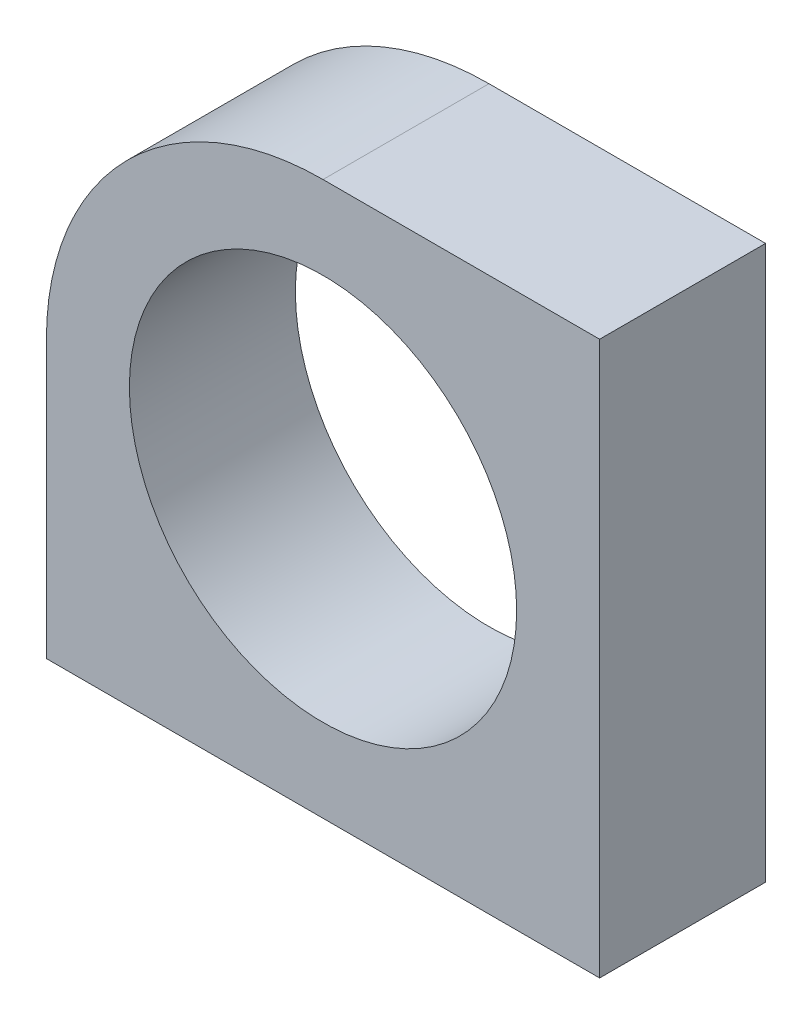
from build123d import *

# Parameters (mm, degrees)
SKETCH1_W           = 10
SKETCH1_H           = 10
BOSS_EXTRUDE1_DEPTH = 3
FILLET1_R           = 5
SKETCH2_R           = 3.5
CUT_EXTRUDE1_DEPTH  = 4


with BuildPart() as part:
    # Sketch1 → Boss-Extrude1 (new body)
    with BuildSketch(Plane.XY):
        with Locations((5, 5)):
            Rectangle(SKETCH1_W, SKETCH1_H)
    extrude(amount=BOSS_EXTRUDE1_DEPTH)

    # Fillet1
    fillet1_edges = [part.edges().sort_by_distance(p)[0] for p in [
        (0, 10, 1.5),
    ]]
    fillet(fillet1_edges, radius=FILLET1_R)

    # Sketch2 → Cut-Extrude1 (cut)
    with BuildSketch(Plane.XY.offset(3)):
        with Locations((5, 5)):
            Circle(SKETCH2_R)
    extrude(amount=-CUT_EXTRUDE1_DEPTH, mode=Mode.SUBTRACT)


solid = part.part
